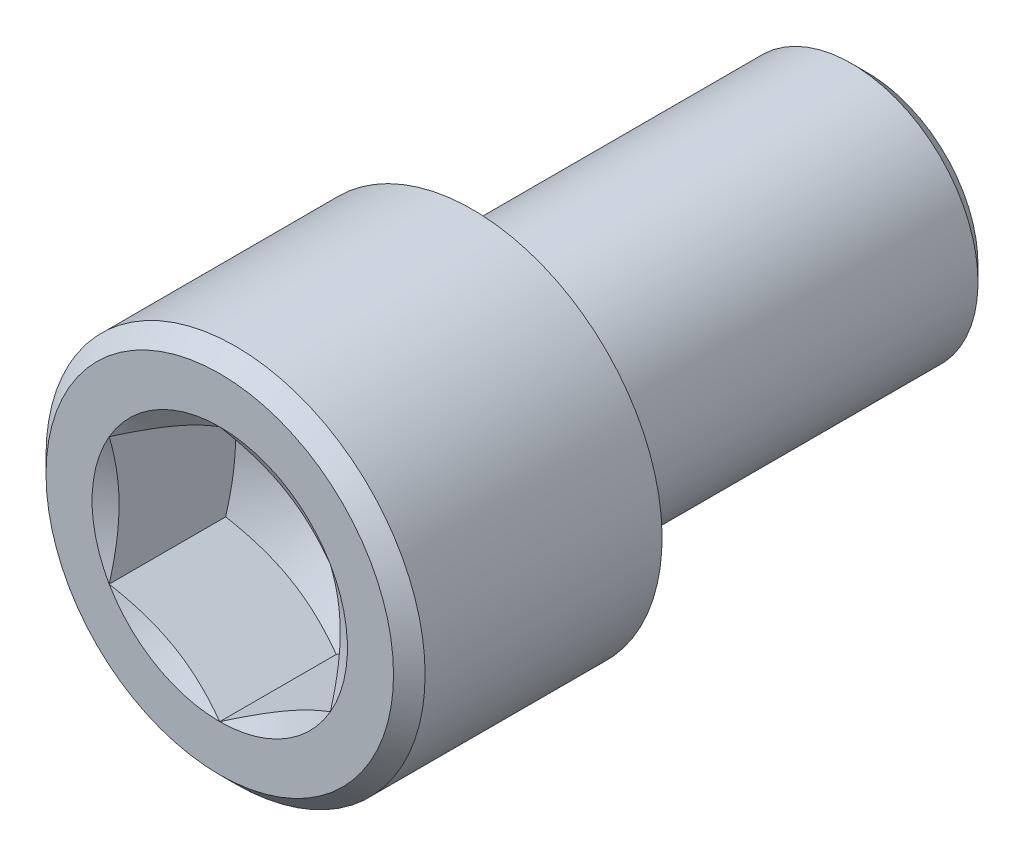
ISO-10303-21;
HEADER;
FILE_DESCRIPTION(('STEP AP214'),'2;1');
FILE_NAME('part.step','',(''),(''),'','','');
FILE_SCHEMA(('AUTOMOTIVE_DESIGN { 1 0 10303 214 1 1 1 1 }'));
ENDSEC;
DATA;
#1=APPLICATION_CONTEXT('core data for automotive mechanical design processes');
#2=APPLICATION_PROTOCOL_DEFINITION('international standard','automotive_design',2000,#1);
#3=PRODUCT_CONTEXT('',#1,'mechanical');
#4=PRODUCT('Part','Part','',(#3));
#5=PRODUCT_RELATED_PRODUCT_CATEGORY('part','',(#4));
#6=PRODUCT_DEFINITION_FORMATION('','',#4);
#7=PRODUCT_DEFINITION_CONTEXT('part definition',#1,'design');
#8=PRODUCT_DEFINITION('design','',#6,#7);
#9=PRODUCT_DEFINITION_SHAPE('','',#8);
#10=(LENGTH_UNIT() NAMED_UNIT(*) SI_UNIT(.MILLI.,.METRE.));
#11=(NAMED_UNIT(*) PLANE_ANGLE_UNIT() SI_UNIT($,.RADIAN.));
#12=(NAMED_UNIT(*) SI_UNIT($,.STERADIAN.) SOLID_ANGLE_UNIT());
#13=UNCERTAINTY_MEASURE_WITH_UNIT(LENGTH_MEASURE(1.E-05),#10,'distance_accuracy_value','');
#14=(GEOMETRIC_REPRESENTATION_CONTEXT(3) GLOBAL_UNCERTAINTY_ASSIGNED_CONTEXT((#13)) GLOBAL_UNIT_ASSIGNED_CONTEXT((#10,
#11,#12)) REPRESENTATION_CONTEXT('',''));
#15=CARTESIAN_POINT('',(0.,0.,0.));
#16=DIRECTION('',(0.,0.,1.));
#17=DIRECTION('',(1.,0.,0.));
#18=AXIS2_PLACEMENT_3D('',#15,#16,#17);
#19=CARTESIAN_POINT('',(0.,12.,16.));
#20=DIRECTION('',(0.,0.,-1.));
#21=DIRECTION('',(0.,1.,0.));
#22=AXIS2_PLACEMENT_3D('',#19,#20,#21);
#23=PLANE('',#22);
#24=CARTESIAN_POINT('',(0.,0.,16.));
#25=DIRECTION('',(0.,0.,-1.));
#26=DIRECTION('',(0.,1.,0.));
#27=AXIS2_PLACEMENT_3D('',#24,#25,#26);
#28=CIRCLE('',#27,11.);
#29=CARTESIAN_POINT('',(0.,11.,16.));
#30=VERTEX_POINT('',#29);
#31=EDGE_CURVE('E298',#30,#30,#28,.F.);
#32=ORIENTED_EDGE('',*,*,#31,.T.);
#33=EDGE_LOOP('',(#32));
#34=FACE_BOUND('',#33,.T.);
#35=CARTESIAN_POINT('',(0.,0.,16.));
#36=DIRECTION('',(0.,0.,-1.));
#37=DIRECTION('',(0.,1.,0.));
#38=AXIS2_PLACEMENT_3D('',#35,#36,#37);
#39=CIRCLE('',#38,8.08290376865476);
#40=CARTESIAN_POINT('',(0.,8.08290376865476,16.));
#41=VERTEX_POINT('',#40);
#42=CARTESIAN_POINT('',(-7.,4.04145188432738,16.));
#43=VERTEX_POINT('',#42);
#44=EDGE_CURVE('E111',#41,#43,#39,.F.);
#45=ORIENTED_EDGE('',*,*,#44,.F.);
#46=CARTESIAN_POINT('',(7.,4.04145188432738,16.));
#47=VERTEX_POINT('',#46);
#48=EDGE_CURVE('E99',#47,#41,#39,.F.);
#49=ORIENTED_EDGE('',*,*,#48,.F.);
#50=CARTESIAN_POINT('',(7.,-4.04145188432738,16.));
#51=VERTEX_POINT('',#50);
#52=EDGE_CURVE('E109',#51,#47,#39,.F.);
#53=ORIENTED_EDGE('',*,*,#52,.F.);
#54=CARTESIAN_POINT('',(0.,-8.08290376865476,16.));
#55=VERTEX_POINT('',#54);
#56=EDGE_CURVE('E442',#55,#51,#39,.F.);
#57=ORIENTED_EDGE('',*,*,#56,.F.);
#58=CARTESIAN_POINT('',(-7.,-4.04145188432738,16.));
#59=VERTEX_POINT('',#58);
#60=EDGE_CURVE('E145',#59,#55,#39,.F.);
#61=ORIENTED_EDGE('',*,*,#60,.F.);
#62=EDGE_CURVE('E141',#43,#59,#39,.F.);
#63=ORIENTED_EDGE('',*,*,#62,.F.);
#64=EDGE_LOOP('',(#45,#49,#53,#57,#61,#63));
#65=FACE_BOUND('',#64,.T.);
#66=ADVANCED_FACE('F42',(#34,#65),#23,.F.);
#67=CARTESIAN_POINT('',(0.,8.,0.));
#68=DIRECTION('',(0.,0.,1.));
#69=DIRECTION('',(0.,-1.,0.));
#70=AXIS2_PLACEMENT_3D('',#67,#68,#69);
#71=PLANE('',#70);
#72=CARTESIAN_POINT('',(0.,0.,0.));
#73=DIRECTION('',(0.,0.,1.));
#74=DIRECTION('',(0.,-1.,0.));
#75=AXIS2_PLACEMENT_3D('',#72,#73,#74);
#76=CIRCLE('',#75,8.6);
#77=CARTESIAN_POINT('',(0.,-8.6,0.));
#78=VERTEX_POINT('',#77);
#79=EDGE_CURVE('E51',#78,#78,#76,.T.);
#80=ORIENTED_EDGE('',*,*,#79,.T.);
#81=EDGE_LOOP('',(#80));
#82=FACE_BOUND('',#81,.T.);
#83=CARTESIAN_POINT('',(0.,0.,0.));
#84=DIRECTION('',(0.,0.,1.));
#85=DIRECTION('',(0.,-1.,0.));
#86=AXIS2_PLACEMENT_3D('',#83,#84,#85);
#87=CIRCLE('',#86,12.);
#88=CARTESIAN_POINT('',(0.,-12.,0.));
#89=VERTEX_POINT('',#88);
#90=EDGE_CURVE('E465',#89,#89,#87,.T.);
#91=ORIENTED_EDGE('',*,*,#90,.F.);
#92=EDGE_LOOP('',(#91));
#93=FACE_BOUND('',#92,.T.);
#94=ADVANCED_FACE('F259',(#82,#93),#71,.F.);
#95=CARTESIAN_POINT('',(0.,0.,16.));
#96=DIRECTION('',(0.,0.,1.));
#97=DIRECTION('',(0.,-1.,0.));
#98=AXIS2_PLACEMENT_3D('',#95,#96,#97);
#99=CYLINDRICAL_SURFACE('',#98,12.);
#100=CARTESIAN_POINT('',(0.,0.,15.));
#101=DIRECTION('',(0.,0.,-1.));
#102=DIRECTION('',(0.,1.,0.));
#103=AXIS2_PLACEMENT_3D('',#100,#101,#102);
#104=CIRCLE('',#103,12.);
#105=CARTESIAN_POINT('',(0.,12.,15.));
#106=VERTEX_POINT('',#105);
#107=EDGE_CURVE('E290',#106,#106,#104,.T.);
#108=ORIENTED_EDGE('',*,*,#107,.T.);
#109=EDGE_LOOP('',(#108));
#110=FACE_BOUND('',#109,.T.);
#111=ORIENTED_EDGE('',*,*,#90,.T.);
#112=EDGE_LOOP('',(#111));
#113=FACE_BOUND('',#112,.T.);
#114=ADVANCED_FACE('F264',(#110,#113),#99,.T.);
#115=CARTESIAN_POINT('',(0.,0.,-25.));
#116=DIRECTION('',(0.,0.,1.));
#117=DIRECTION('',(0.,-1.,0.));
#118=AXIS2_PLACEMENT_3D('',#115,#116,#117);
#119=PLANE('',#118);
#120=CARTESIAN_POINT('',(0.,0.,-25.));
#121=DIRECTION('',(0.,0.,1.));
#122=DIRECTION('',(0.,-1.,0.));
#123=AXIS2_PLACEMENT_3D('',#120,#121,#122);
#124=CIRCLE('',#123,7.);
#125=CARTESIAN_POINT('',(0.,-7.,-25.));
#126=VERTEX_POINT('',#125);
#127=EDGE_CURVE('E122',#126,#126,#124,.F.);
#128=ORIENTED_EDGE('',*,*,#127,.T.);
#129=EDGE_LOOP('',(#128));
#130=FACE_BOUND('',#129,.T.);
#131=ADVANCED_FACE('F269',(#130),#119,.F.);
#132=CARTESIAN_POINT('',(0.,0.,16.));
#133=DIRECTION('',(0.,0.,1.));
#134=DIRECTION('',(0.,-1.,0.));
#135=AXIS2_PLACEMENT_3D('',#132,#133,#134);
#136=CYLINDRICAL_SURFACE('',#135,8.);
#137=CARTESIAN_POINT('',(0.,0.,-0.6));
#138=DIRECTION('',(0.,0.,1.));
#139=DIRECTION('',(0.,-1.,0.));
#140=AXIS2_PLACEMENT_3D('',#137,#138,#139);
#141=CIRCLE('',#140,8.);
#142=CARTESIAN_POINT('',(0.,-8.,-0.6));
#143=VERTEX_POINT('',#142);
#144=EDGE_CURVE('E12',#143,#143,#141,.F.);
#145=ORIENTED_EDGE('',*,*,#144,.T.);
#146=EDGE_LOOP('',(#145));
#147=FACE_BOUND('',#146,.T.);
#148=CARTESIAN_POINT('',(0.,0.,-24.));
#149=DIRECTION('',(0.,0.,1.));
#150=DIRECTION('',(0.,-1.,0.));
#151=AXIS2_PLACEMENT_3D('',#148,#149,#150);
#152=CIRCLE('',#151,8.);
#153=CARTESIAN_POINT('',(0.,-8.,-24.));
#154=VERTEX_POINT('',#153);
#155=EDGE_CURVE('E287',#154,#154,#152,.T.);
#156=ORIENTED_EDGE('',*,*,#155,.T.);
#157=EDGE_LOOP('',(#156));
#158=FACE_BOUND('',#157,.T.);
#159=ADVANCED_FACE('F180',(#147,#158),#136,.T.);
#160=CARTESIAN_POINT('',(0.,0.,16.));
#161=DIRECTION('',(0.,0.,-1.));
#162=DIRECTION('',(0.,1.,0.));
#163=AXIS2_PLACEMENT_3D('',#160,#161,#162);
#164=CONICAL_SURFACE('',#163,11.,0.785398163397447);
#165=ORIENTED_EDGE('',*,*,#107,.F.);
#166=EDGE_LOOP('',(#165));
#167=FACE_BOUND('',#166,.T.);
#168=ORIENTED_EDGE('',*,*,#31,.F.);
#169=EDGE_LOOP('',(#168));
#170=FACE_BOUND('',#169,.T.);
#171=ADVANCED_FACE('F273',(#167,#170),#164,.T.);
#172=CARTESIAN_POINT('',(0.,0.,-24.));
#173=DIRECTION('',(0.,0.,1.));
#174=DIRECTION('',(0.,-1.,0.));
#175=AXIS2_PLACEMENT_3D('',#172,#173,#174);
#176=CONICAL_SURFACE('',#175,8.,0.785398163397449);
#177=ORIENTED_EDGE('',*,*,#127,.F.);
#178=EDGE_LOOP('',(#177));
#179=FACE_BOUND('',#178,.T.);
#180=ORIENTED_EDGE('',*,*,#155,.F.);
#181=EDGE_LOOP('',(#180));
#182=FACE_BOUND('',#181,.T.);
#183=ADVANCED_FACE('F275',(#179,#182),#176,.T.);
#184=CARTESIAN_POINT('',(0.,0.,15.3747852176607));
#185=DIRECTION('',(0.,0.,1.));
#186=DIRECTION('',(0.,-1.,0.));
#187=AXIS2_PLACEMENT_3D('',#184,#185,#186);
#188=CONICAL_SURFACE('',#187,7.,1.04719755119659);
#189=ORIENTED_EDGE('',*,*,#44,.T.);
#190=CARTESIAN_POINT('',(-7.0002,4.04133641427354,16.0000666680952));
#191=CARTESIAN_POINT('',(-6.84633209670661,4.13017208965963,15.9487850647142));
#192=CARTESIAN_POINT('',(-6.69189049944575,4.21933898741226,15.8998308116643));
#193=CARTESIAN_POINT('',(-6.38175307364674,4.39839691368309,15.8072180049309));
#194=CARTESIAN_POINT('',(-6.22605673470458,4.48828823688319,15.7635617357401));
#195=CARTESIAN_POINT('',(-5.75647483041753,4.75940147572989,15.6413968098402));
#196=CARTESIAN_POINT('',(-5.4407356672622,4.94169356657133,15.5719107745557));
#197=CARTESIAN_POINT('',(-4.96823775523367,5.21449036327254,15.4904301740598));
#198=CARTESIAN_POINT('',(-4.81289077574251,5.30417998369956,15.4672187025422));
#199=CARTESIAN_POINT('',(-4.50149488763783,5.48396448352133,15.4282964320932));
#200=CARTESIAN_POINT('',(-4.34544604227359,5.57405932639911,15.4125849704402));
#201=CARTESIAN_POINT('',(-4.03307732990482,5.75440548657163,15.3890631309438));
#202=CARTESIAN_POINT('',(-3.87675797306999,5.84465650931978,15.3812437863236));
#203=CARTESIAN_POINT('',(-3.56398349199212,6.02523694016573,15.373665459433));
#204=CARTESIAN_POINT('',(-3.40752837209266,6.11556634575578,15.3739062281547));
#205=CARTESIAN_POINT('',(-2.97889312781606,6.36303901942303,15.3856449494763));
#206=CARTESIAN_POINT('',(-2.7068533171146,6.52010127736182,15.4053509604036));
#207=CARTESIAN_POINT('',(-2.1645805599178,6.83318259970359,15.4678386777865));
#208=CARTESIAN_POINT('',(-1.89434952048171,6.9892005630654,15.5106417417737));
#209=CARTESIAN_POINT('',(-1.35098545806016,7.30291195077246,15.6176368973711));
#210=CARTESIAN_POINT('',(-1.07792099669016,7.46056579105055,15.6822823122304));
#211=CARTESIAN_POINT('',(-0.53586421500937,7.77352241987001,15.8290012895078));
#212=CARTESIAN_POINT('',(-0.26686495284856,7.92882921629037,15.9110403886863));
#213=CARTESIAN_POINT('',(0.000199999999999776,8.0830192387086,16.0000666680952));
#214=B_SPLINE_CURVE_WITH_KNOTS('',3,(#190,#191,#192,#193,#194,#195,#196,#197,#198,#199,#200,
#201,#202,#203,#204,#205,#206,#207,#208,#209,#210,#211,#212,#213),.UNSPECIFIED.,.F.,.F.,(4,2,2,
2,2,2,2,2,2,2,2,4),(0.,0.554727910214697,1.1096941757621,2.22193274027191,2.76443041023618,
3.30688013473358,3.84871284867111,4.3905288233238,5.33376515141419,6.27787517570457,
7.24292418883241,8.20607866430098),.UNSPECIFIED.);
#215=EDGE_CURVE('E115',#43,#41,#214,.T.);
#216=ORIENTED_EDGE('',*,*,#215,.T.);
#217=EDGE_LOOP('',(#189,#216));
#218=FACE_BOUND('',#217,.T.);
#219=ADVANCED_FACE('F116',(#218),#188,.F.);
#220=ORIENTED_EDGE('',*,*,#62,.T.);
#221=CARTESIAN_POINT('',(-7.,-10.718525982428,18.7244721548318));
#222=CARTESIAN_POINT('',(-7.,-10.4111863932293,18.5759486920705));
#223=CARTESIAN_POINT('',(-7.,-10.1031201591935,18.4289016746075));
#224=CARTESIAN_POINT('',(-7.,-9.48514148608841,18.1386042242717));
#225=CARTESIAN_POINT('',(-7.,-9.1752287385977,17.9953544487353));
#226=CARTESIAN_POINT('',(-7.,-8.55148999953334,17.7127405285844));
#227=CARTESIAN_POINT('',(-7.,-8.23765176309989,17.5734033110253));
#228=CARTESIAN_POINT('',(-7.,-7.60739587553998,17.300713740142));
#229=CARTESIAN_POINT('',(-7.,-7.29097835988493,17.1673610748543));
#230=CARTESIAN_POINT('',(-7.,-6.65113230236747,16.9066488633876));
#231=CARTESIAN_POINT('',(-7.,-6.32766537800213,16.779382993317));
#232=CARTESIAN_POINT('',(-7.,-5.67691706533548,16.534818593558));
#233=CARTESIAN_POINT('',(-7.,-5.34963525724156,16.4175211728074));
#234=CARTESIAN_POINT('',(-7.,-4.6914046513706,16.1960458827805));
#235=CARTESIAN_POINT('',(-7.,-4.36046534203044,16.0918401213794));
#236=CARTESIAN_POINT('',(-7.,-3.69389387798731,15.8999306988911));
#237=CARTESIAN_POINT('',(-7.,-3.35826324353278,15.812221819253));
#238=CARTESIAN_POINT('',(-7.,-2.68202380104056,15.6575705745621));
#239=CARTESIAN_POINT('',(-7.,-2.34141369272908,15.5906337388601));
#240=CARTESIAN_POINT('',(-7.,-1.82750129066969,15.5091591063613));
#241=CARTESIAN_POINT('',(-7.,-1.65567653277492,15.4851542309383));
#242=CARTESIAN_POINT('',(-7.,-1.31122142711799,15.4439270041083));
#243=CARTESIAN_POINT('',(-7.,-1.13859116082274,15.426703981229));
#244=CARTESIAN_POINT('',(-7.,-0.793853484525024,15.3995039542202));
#245=CARTESIAN_POINT('',(-7.,-0.621749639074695,15.3894819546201));
#246=CARTESIAN_POINT('',(-7.,-0.277271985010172,15.3767369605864));
#247=CARTESIAN_POINT('',(-7.,-0.104898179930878,15.3740138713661));
#248=CARTESIAN_POINT('',(-7.,0.239760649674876,15.3759315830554));
#249=CARTESIAN_POINT('',(-7.,0.412045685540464,15.3805703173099));
#250=CARTESIAN_POINT('',(-7.,0.756270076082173,15.3970963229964));
#251=CARTESIAN_POINT('',(-7.,0.928209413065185,15.408983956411));
#252=CARTESIAN_POINT('',(-7.,1.34493742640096,15.4463326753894));
#253=CARTESIAN_POINT('',(-7.,1.58940592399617,15.4754257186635));
#254=CARTESIAN_POINT('',(-7.,2.07646957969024,15.5466512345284));
#255=CARTESIAN_POINT('',(-7.,2.31906420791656,15.5887872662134));
#256=CARTESIAN_POINT('',(-7.,2.80217998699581,15.6846043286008));
#257=CARTESIAN_POINT('',(-7.,3.04269895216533,15.7382962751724));
#258=CARTESIAN_POINT('',(-7.,3.52126228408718,15.8555869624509));
#259=CARTESIAN_POINT('',(-7.,3.75930688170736,15.9191847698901));
#260=CARTESIAN_POINT('',(-7.,4.23878446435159,16.0564281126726));
#261=CARTESIAN_POINT('',(-7.,4.48015747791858,16.1302817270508));
#262=CARTESIAN_POINT('',(-7.,4.96035218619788,16.2852861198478));
#263=CARTESIAN_POINT('',(-7.,5.1991755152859,16.3664318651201));
#264=CARTESIAN_POINT('',(-7.,5.67331254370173,16.5343443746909));
#265=CARTESIAN_POINT('',(-7.,5.90863843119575,16.6210769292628));
#266=CARTESIAN_POINT('',(-7.,6.377464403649,16.7996327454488));
#267=CARTESIAN_POINT('',(-7.,6.61096370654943,16.8914580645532));
#268=CARTESIAN_POINT('',(-7.,6.8436147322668,16.9853259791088));
#269=B_SPLINE_CURVE_WITH_KNOTS('',3,(#221,#222,#223,#224,#225,#226,#227,#228,#229,#230,#231,
#232,#233,#234,#235,#236,#237,#238,#239,#240,#241,#242,#243,#244,#245,#246,#247,#248,#249,#250,
#251,#252,#253,#254,#255,#256,#257,#258,#259,#260,#261,#262,#263,#264,#265,#266,#267,#268),
.UNSPECIFIED.,.F.,.F.,(4,2,2,2,2,2,2,2,2,2,2,2,2,2,2,2,2,2,2,2,2,2,2,4),(0.,1.02405063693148,
2.04827740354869,3.07836540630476,4.10839964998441,5.15107951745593,6.19387522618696,
7.23441013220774,8.27461532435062,9.31509717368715,9.83546471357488,10.35578071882,
10.8728165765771,11.3898457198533,11.9067297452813,12.4236395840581,13.1618088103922,
13.9001796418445,14.6392510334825,15.3782528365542,16.1353691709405,16.8919668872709,
17.6443059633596,18.3969512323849),.UNSPECIFIED.);
#270=EDGE_CURVE('E242',#59,#43,#269,.T.);
#271=ORIENTED_EDGE('',*,*,#270,.T.);
#272=EDGE_LOOP('',(#220,#271));
#273=FACE_BOUND('',#272,.T.);
#274=ADVANCED_FACE('F281',(#273),#188,.F.);
#275=ORIENTED_EDGE('',*,*,#60,.T.);
#276=CARTESIAN_POINT('',(0.000200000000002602,-8.0830192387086,16.0000666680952));
#277=CARTESIAN_POINT('',(-0.153667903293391,-7.99418356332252,15.9487850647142));
#278=CARTESIAN_POINT('',(-0.308109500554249,-7.90501666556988,15.8998308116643));
#279=CARTESIAN_POINT('',(-0.618246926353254,-7.72595873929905,15.8072180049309));
#280=CARTESIAN_POINT('',(-0.773943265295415,-7.63606741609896,15.7635617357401));
#281=CARTESIAN_POINT('',(-1.24352516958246,-7.36495417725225,15.6413968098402));
#282=CARTESIAN_POINT('',(-1.5592643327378,-7.18266208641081,15.5719107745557));
#283=CARTESIAN_POINT('',(-2.03176224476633,-6.9098652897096,15.4904301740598));
#284=CARTESIAN_POINT('',(-2.18710922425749,-6.82017566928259,15.4672187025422));
#285=CARTESIAN_POINT('',(-2.49850511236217,-6.64039116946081,15.4282964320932));
#286=CARTESIAN_POINT('',(-2.65455395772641,-6.55029632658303,15.4125849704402));
#287=CARTESIAN_POINT('',(-2.96692267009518,-6.36995016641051,15.3890631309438));
#288=CARTESIAN_POINT('',(-3.12324202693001,-6.27969914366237,15.3812437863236));
#289=CARTESIAN_POINT('',(-3.43601650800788,-6.09911871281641,15.373665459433));
#290=CARTESIAN_POINT('',(-3.59247162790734,-6.00878930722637,15.3739062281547));
#291=CARTESIAN_POINT('',(-4.02110687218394,-5.76131663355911,15.3856449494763));
#292=CARTESIAN_POINT('',(-4.2931466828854,-5.60425437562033,15.4053509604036));
#293=CARTESIAN_POINT('',(-4.8354194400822,-5.29117305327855,15.4678386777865));
#294=CARTESIAN_POINT('',(-5.10565047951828,-5.13515508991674,15.5106417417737));
#295=CARTESIAN_POINT('',(-5.64901454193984,-4.82144370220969,15.6176368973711));
#296=CARTESIAN_POINT('',(-5.92207900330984,-4.66378986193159,15.6822823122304));
#297=CARTESIAN_POINT('',(-6.46413578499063,-4.35083323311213,15.8290012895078));
#298=CARTESIAN_POINT('',(-6.73313504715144,-4.19552643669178,15.9110403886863));
#299=CARTESIAN_POINT('',(-7.0002,-4.04133641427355,16.0000666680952));
#300=B_SPLINE_CURVE_WITH_KNOTS('',3,(#276,#277,#278,#279,#280,#281,#282,#283,#284,#285,#286,
#287,#288,#289,#290,#291,#292,#293,#294,#295,#296,#297,#298,#299),.UNSPECIFIED.,.F.,.F.,(4,2,2,
2,2,2,2,2,2,2,2,4),(0.,0.554727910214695,1.10969417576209,2.2219327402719,2.76443041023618,
3.30688013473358,3.84871284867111,4.3905288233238,5.33376515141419,6.27787517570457,
7.2429241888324,8.20607866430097),.UNSPECIFIED.);
#301=EDGE_CURVE('E235',#55,#59,#300,.T.);
#302=ORIENTED_EDGE('',*,*,#301,.T.);
#303=EDGE_LOOP('',(#275,#302));
#304=FACE_BOUND('',#303,.T.);
#305=ADVANCED_FACE('F381',(#304),#188,.F.);
#306=ORIENTED_EDGE('',*,*,#56,.T.);
#307=CARTESIAN_POINT('',(7.0002,-4.04133641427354,16.0000666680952));
#308=CARTESIAN_POINT('',(6.84633209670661,-4.13017208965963,15.9487850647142));
#309=CARTESIAN_POINT('',(6.69189049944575,-4.21933898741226,15.8998308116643));
#310=CARTESIAN_POINT('',(6.38175307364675,-4.39839691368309,15.8072180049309));
#311=CARTESIAN_POINT('',(6.22605673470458,-4.48828823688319,15.7635617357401));
#312=CARTESIAN_POINT('',(5.75647483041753,-4.7594014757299,15.6413968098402));
#313=CARTESIAN_POINT('',(5.4407356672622,-4.94169356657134,15.5719107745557));
#314=CARTESIAN_POINT('',(4.96823775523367,-5.21449036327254,15.4904301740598));
#315=CARTESIAN_POINT('',(4.81289077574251,-5.30417998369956,15.4672187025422));
#316=CARTESIAN_POINT('',(4.50149488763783,-5.48396448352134,15.4282964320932));
#317=CARTESIAN_POINT('',(4.34544604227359,-5.57405932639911,15.4125849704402));
#318=CARTESIAN_POINT('',(4.03307732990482,-5.75440548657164,15.3890631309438));
#319=CARTESIAN_POINT('',(3.87675797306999,-5.84465650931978,15.3812437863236));
#320=CARTESIAN_POINT('',(3.56398349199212,-6.02523694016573,15.373665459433));
#321=CARTESIAN_POINT('',(3.40752837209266,-6.11556634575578,15.3739062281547));
#322=CARTESIAN_POINT('',(2.97889312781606,-6.36303901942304,15.3856449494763));
#323=CARTESIAN_POINT('',(2.7068533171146,-6.52010127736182,15.4053509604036));
#324=CARTESIAN_POINT('',(2.1645805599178,-6.83318259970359,15.4678386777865));
#325=CARTESIAN_POINT('',(1.89434952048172,-6.98920056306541,15.5106417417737));
#326=CARTESIAN_POINT('',(1.35098545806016,-7.30291195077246,15.6176368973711));
#327=CARTESIAN_POINT('',(1.07792099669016,-7.46056579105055,15.6822823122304));
#328=CARTESIAN_POINT('',(0.535864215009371,-7.77352241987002,15.8290012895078));
#329=CARTESIAN_POINT('',(0.266864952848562,-7.92882921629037,15.9110403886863));
#330=CARTESIAN_POINT('',(-0.000199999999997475,-8.0830192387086,16.0000666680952));
#331=B_SPLINE_CURVE_WITH_KNOTS('',3,(#307,#308,#309,#310,#311,#312,#313,#314,#315,#316,#317,
#318,#319,#320,#321,#322,#323,#324,#325,#326,#327,#328,#329,#330),.UNSPECIFIED.,.F.,.F.,(4,2,2,
2,2,2,2,2,2,2,2,4),(0.,0.554727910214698,1.10969417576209,2.22193274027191,2.76443041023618,
3.30688013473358,3.84871284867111,4.3905288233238,5.33376515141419,6.27787517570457,
7.24292418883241,8.20607866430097),.UNSPECIFIED.);
#332=EDGE_CURVE('E63',#51,#55,#331,.T.);
#333=ORIENTED_EDGE('',*,*,#332,.T.);
#334=EDGE_LOOP('',(#306,#333));
#335=FACE_BOUND('',#334,.T.);
#336=ADVANCED_FACE('F374',(#335),#188,.F.);
#337=ORIENTED_EDGE('',*,*,#52,.T.);
#338=CARTESIAN_POINT('',(7.,-10.718525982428,18.7244721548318));
#339=CARTESIAN_POINT('',(7.,-10.4111863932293,18.5759486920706));
#340=CARTESIAN_POINT('',(7.,-10.1031201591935,18.4289016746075));
#341=CARTESIAN_POINT('',(7.,-9.48514148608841,18.1386042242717));
#342=CARTESIAN_POINT('',(7.,-9.17522873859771,17.9953544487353));
#343=CARTESIAN_POINT('',(7.,-8.55148999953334,17.7127405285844));
#344=CARTESIAN_POINT('',(7.,-8.23765176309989,17.5734033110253));
#345=CARTESIAN_POINT('',(7.,-7.60739587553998,17.300713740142));
#346=CARTESIAN_POINT('',(7.,-7.29097835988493,17.1673610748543));
#347=CARTESIAN_POINT('',(7.,-6.65113230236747,16.9066488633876));
#348=CARTESIAN_POINT('',(7.,-6.32766537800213,16.779382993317));
#349=CARTESIAN_POINT('',(7.,-5.67691706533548,16.534818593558));
#350=CARTESIAN_POINT('',(7.,-5.34963525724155,16.4175211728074));
#351=CARTESIAN_POINT('',(7.,-4.6914046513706,16.1960458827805));
#352=CARTESIAN_POINT('',(7.,-4.36046534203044,16.0918401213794));
#353=CARTESIAN_POINT('',(7.,-3.69389387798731,15.8999306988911));
#354=CARTESIAN_POINT('',(7.,-3.35826324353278,15.812221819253));
#355=CARTESIAN_POINT('',(7.,-2.68202380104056,15.6575705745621));
#356=CARTESIAN_POINT('',(7.,-2.34141369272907,15.5906337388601));
#357=CARTESIAN_POINT('',(7.,-1.82750129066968,15.5091591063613));
#358=CARTESIAN_POINT('',(7.,-1.65567653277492,15.4851542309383));
#359=CARTESIAN_POINT('',(7.,-1.31122142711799,15.4439270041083));
#360=CARTESIAN_POINT('',(7.,-1.13859116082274,15.426703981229));
#361=CARTESIAN_POINT('',(7.,-0.793853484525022,15.3995039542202));
#362=CARTESIAN_POINT('',(7.,-0.621749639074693,15.3894819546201));
#363=CARTESIAN_POINT('',(7.,-0.27727198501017,15.3767369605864));
#364=CARTESIAN_POINT('',(7.,-0.104898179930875,15.3740138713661));
#365=CARTESIAN_POINT('',(7.,0.239760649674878,15.3759315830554));
#366=CARTESIAN_POINT('',(7.,0.412045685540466,15.3805703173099));
#367=CARTESIAN_POINT('',(7.,0.756270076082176,15.3970963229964));
#368=CARTESIAN_POINT('',(7.,0.928209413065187,15.408983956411));
#369=CARTESIAN_POINT('',(7.,1.34493742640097,15.4463326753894));
#370=CARTESIAN_POINT('',(7.,1.58940592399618,15.4754257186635));
#371=CARTESIAN_POINT('',(7.,2.07646957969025,15.5466512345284));
#372=CARTESIAN_POINT('',(7.,2.31906420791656,15.5887872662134));
#373=CARTESIAN_POINT('',(7.,2.80217998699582,15.6846043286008));
#374=CARTESIAN_POINT('',(7.,3.04269895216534,15.7382962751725));
#375=CARTESIAN_POINT('',(7.,3.52126228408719,15.8555869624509));
#376=CARTESIAN_POINT('',(7.,3.75930688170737,15.9191847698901));
#377=CARTESIAN_POINT('',(7.,4.2387844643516,16.0564281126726));
#378=CARTESIAN_POINT('',(7.,4.48015747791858,16.1302817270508));
#379=CARTESIAN_POINT('',(7.,4.96035218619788,16.2852861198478));
#380=CARTESIAN_POINT('',(7.,5.1991755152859,16.3664318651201));
#381=CARTESIAN_POINT('',(7.,5.67331254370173,16.5343443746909));
#382=CARTESIAN_POINT('',(7.,5.90863843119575,16.6210769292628));
#383=CARTESIAN_POINT('',(7.,6.377464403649,16.7996327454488));
#384=CARTESIAN_POINT('',(7.,6.61096370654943,16.8914580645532));
#385=CARTESIAN_POINT('',(7.,6.84361473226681,16.9853259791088));
#386=B_SPLINE_CURVE_WITH_KNOTS('',3,(#338,#339,#340,#341,#342,#343,#344,#345,#346,#347,#348,
#349,#350,#351,#352,#353,#354,#355,#356,#357,#358,#359,#360,#361,#362,#363,#364,#365,#366,#367,
#368,#369,#370,#371,#372,#373,#374,#375,#376,#377,#378,#379,#380,#381,#382,#383,#384,#385),
.UNSPECIFIED.,.F.,.F.,(4,2,2,2,2,2,2,2,2,2,2,2,2,2,2,2,2,2,2,2,2,2,2,4),(0.,1.02405063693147,
2.04827740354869,3.07836540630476,4.10839964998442,5.15107951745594,6.19387522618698,
7.23441013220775,8.27461532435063,9.31509717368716,9.83546471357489,10.35578071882,
10.8728165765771,11.3898457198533,11.9067297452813,12.4236395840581,13.1618088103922,
13.9001796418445,14.6392510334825,15.3782528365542,16.1353691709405,16.8919668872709,
17.6443059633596,18.3969512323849),.UNSPECIFIED.);
#387=EDGE_CURVE('E57',#47,#51,#386,.F.);
#388=ORIENTED_EDGE('',*,*,#387,.T.);
#389=EDGE_LOOP('',(#337,#388));
#390=FACE_BOUND('',#389,.T.);
#391=ADVANCED_FACE('F367',(#390),#188,.F.);
#392=ORIENTED_EDGE('',*,*,#48,.T.);
#393=CARTESIAN_POINT('',(-0.000200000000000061,8.0830192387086,16.0000666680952));
#394=CARTESIAN_POINT('',(0.153667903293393,7.99418356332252,15.9487850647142));
#395=CARTESIAN_POINT('',(0.308109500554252,7.90501666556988,15.8998308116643));
#396=CARTESIAN_POINT('',(0.618246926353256,7.72595873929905,15.8072180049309));
#397=CARTESIAN_POINT('',(0.773943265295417,7.63606741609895,15.7635617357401));
#398=CARTESIAN_POINT('',(1.24352516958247,7.36495417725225,15.6413968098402));
#399=CARTESIAN_POINT('',(1.5592643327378,7.18266208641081,15.5719107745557));
#400=CARTESIAN_POINT('',(2.03176224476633,6.9098652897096,15.4904301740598));
#401=CARTESIAN_POINT('',(2.18710922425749,6.82017566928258,15.4672187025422));
#402=CARTESIAN_POINT('',(2.49850511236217,6.64039116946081,15.4282964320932));
#403=CARTESIAN_POINT('',(2.65455395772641,6.55029632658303,15.4125849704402));
#404=CARTESIAN_POINT('',(2.96692267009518,6.36995016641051,15.3890631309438));
#405=CARTESIAN_POINT('',(3.12324202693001,6.27969914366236,15.3812437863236));
#406=CARTESIAN_POINT('',(3.43601650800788,6.09911871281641,15.373665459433));
#407=CARTESIAN_POINT('',(3.59247162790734,6.00878930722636,15.3739062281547));
#408=CARTESIAN_POINT('',(4.02110687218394,5.76131663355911,15.3856449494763));
#409=CARTESIAN_POINT('',(4.2931466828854,5.60425437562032,15.4053509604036));
#410=CARTESIAN_POINT('',(4.8354194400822,5.29117305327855,15.4678386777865));
#411=CARTESIAN_POINT('',(5.10565047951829,5.13515508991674,15.5106417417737));
#412=CARTESIAN_POINT('',(5.64901454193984,4.82144370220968,15.6176368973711));
#413=CARTESIAN_POINT('',(5.92207900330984,4.66378986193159,15.6822823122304));
#414=CARTESIAN_POINT('',(6.46413578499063,4.35083323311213,15.8290012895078));
#415=CARTESIAN_POINT('',(6.73313504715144,4.19552643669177,15.9110403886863));
#416=CARTESIAN_POINT('',(7.0002,4.04133641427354,16.0000666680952));
#417=B_SPLINE_CURVE_WITH_KNOTS('',3,(#393,#394,#395,#396,#397,#398,#399,#400,#401,#402,#403,
#404,#405,#406,#407,#408,#409,#410,#411,#412,#413,#414,#415,#416),.UNSPECIFIED.,.F.,.F.,(4,2,2,
2,2,2,2,2,2,2,2,4),(0.,0.554727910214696,1.10969417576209,2.2219327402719,2.76443041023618,
3.30688013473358,3.84871284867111,4.3905288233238,5.33376515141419,6.27787517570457,
7.24292418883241,8.20607866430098),.UNSPECIFIED.);
#418=EDGE_CURVE('E103',#41,#47,#417,.T.);
#419=ORIENTED_EDGE('',*,*,#418,.T.);
#420=EDGE_LOOP('',(#392,#419));
#421=FACE_BOUND('',#420,.T.);
#422=ADVANCED_FACE('F101',(#421),#188,.F.);
#423=CARTESIAN_POINT('',(0.,0.,3.95854811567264));
#424=DIRECTION('',(0.,0.,1.));
#425=DIRECTION('',(1.,0.,0.));
#426=AXIS2_PLACEMENT_3D('',#423,#424,#425);
#427=CONICAL_SURFACE('',#426,0.,1.0471975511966);
#428=CARTESIAN_POINT('',(7.0002,-4.04133641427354,8.6252814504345));
#429=CARTESIAN_POINT('',(6.84633209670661,-4.13017208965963,8.57399984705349));
#430=CARTESIAN_POINT('',(6.69189049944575,-4.21933898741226,8.52504559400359));
#431=CARTESIAN_POINT('',(6.38175307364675,-4.39839691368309,8.43243278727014));
#432=CARTESIAN_POINT('',(6.22605673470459,-4.48828823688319,8.38877651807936));
#433=CARTESIAN_POINT('',(5.75647483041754,-4.7594014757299,8.2666115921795));
#434=CARTESIAN_POINT('',(5.4407356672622,-4.94169356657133,8.19712555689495));
#435=CARTESIAN_POINT('',(4.96823775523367,-5.21449036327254,8.1156449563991));
#436=CARTESIAN_POINT('',(4.81289077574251,-5.30417998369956,8.09243348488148));
#437=CARTESIAN_POINT('',(4.50149488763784,-5.48396448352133,8.05351121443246));
#438=CARTESIAN_POINT('',(4.34544604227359,-5.57405932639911,8.03779975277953));
#439=CARTESIAN_POINT('',(4.03307732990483,-5.75440548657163,8.01427791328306));
#440=CARTESIAN_POINT('',(3.87675797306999,-5.84465650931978,8.00645856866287));
#441=CARTESIAN_POINT('',(3.56398349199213,-6.02523694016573,7.99888024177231));
#442=CARTESIAN_POINT('',(3.40752837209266,-6.11556634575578,7.99912101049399));
#443=CARTESIAN_POINT('',(2.97889312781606,-6.36303901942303,8.01085973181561));
#444=CARTESIAN_POINT('',(2.7068533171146,-6.52010127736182,8.03056574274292));
#445=CARTESIAN_POINT('',(2.16458055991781,-6.83318259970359,8.09305346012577));
#446=CARTESIAN_POINT('',(1.89434952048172,-6.9892005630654,8.13585652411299));
#447=CARTESIAN_POINT('',(1.35098545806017,-7.30291195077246,8.24285167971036));
#448=CARTESIAN_POINT('',(1.07792099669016,-7.46056579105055,8.30749709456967));
#449=CARTESIAN_POINT('',(0.535864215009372,-7.77352241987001,8.45421607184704));
#450=CARTESIAN_POINT('',(0.266864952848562,-7.92882921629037,8.53625517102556));
#451=CARTESIAN_POINT('',(-0.000199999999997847,-8.0830192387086,8.6252814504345));
#452=B_SPLINE_CURVE_WITH_KNOTS('',3,(#428,#429,#430,#431,#432,#433,#434,#435,#436,#437,#438,
#439,#440,#441,#442,#443,#444,#445,#446,#447,#448,#449,#450,#451),.UNSPECIFIED.,.F.,.F.,(4,2,2,
2,2,2,2,2,2,2,2,4),(0.,0.554727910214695,1.10969417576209,2.2219327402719,2.76443041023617,
3.30688013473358,3.8487128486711,4.39052882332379,5.33376515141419,6.27787517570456,
7.2429241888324,8.20607866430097),.UNSPECIFIED.);
#453=CARTESIAN_POINT('',(7.,-4.04145188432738,8.62521478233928));
#454=VERTEX_POINT('',#453);
#455=CARTESIAN_POINT('',(0.,-8.08290376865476,8.62521478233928));
#456=VERTEX_POINT('',#455);
#457=EDGE_CURVE('E194',#454,#456,#452,.T.);
#458=ORIENTED_EDGE('',*,*,#457,.F.);
#459=CARTESIAN_POINT('',(7.,-10.7633874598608,11.3713862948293));
#460=CARTESIAN_POINT('',(7.,-10.458142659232,11.2236898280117));
#461=CARTESIAN_POINT('',(7.,-10.1521865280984,11.0774377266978));
#462=CARTESIAN_POINT('',(7.,-9.53847237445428,10.7886375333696));
#463=CARTESIAN_POINT('',(7.,-9.2307140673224,10.6460900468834));
#464=CARTESIAN_POINT('',(7.,-8.61138894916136,10.364778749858));
#465=CARTESIAN_POINT('',(7.,-8.29981046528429,10.2260405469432));
#466=CARTESIAN_POINT('',(7.,-7.67413940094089,9.95437598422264));
#467=CARTESIAN_POINT('',(7.,-7.3600469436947,9.82144934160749));
#468=CARTESIAN_POINT('',(7.,-6.7196404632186,9.55917679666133));
#469=CARTESIAN_POINT('',(7.,-6.39323699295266,9.43004807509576));
#470=CARTESIAN_POINT('',(7.,-5.73658007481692,9.18178926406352));
#471=CARTESIAN_POINT('',(7.,-5.40632619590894,9.06266030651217));
#472=CARTESIAN_POINT('',(7.,-4.74208483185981,8.83759250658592));
#473=CARTESIAN_POINT('',(7.,-4.40810672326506,8.73162629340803));
#474=CARTESIAN_POINT('',(7.,-3.73537729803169,8.53634034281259));
#475=CARTESIAN_POINT('',(7.,-3.39662754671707,8.44701527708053));
#476=CARTESIAN_POINT('',(7.,-2.71568951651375,8.28976378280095));
#477=CARTESIAN_POINT('',(7.,-2.37352397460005,8.22174159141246));
#478=CARTESIAN_POINT('',(7.,-1.8572385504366,8.13873768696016));
#479=CARTESIAN_POINT('',(7.,-1.68462548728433,8.11424027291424));
#480=CARTESIAN_POINT('',(7.,-1.33857322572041,8.0720705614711));
#481=CARTESIAN_POINT('',(7.,-1.16513410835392,8.05439760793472));
#482=CARTESIAN_POINT('',(7.,-0.819874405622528,8.0264447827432));
#483=CARTESIAN_POINT('',(7.,-0.648061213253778,8.01607393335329));
#484=CARTESIAN_POINT('',(7.,-0.304150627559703,8.00260048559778));
#485=CARTESIAN_POINT('',(7.,-0.132053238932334,7.99949776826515));
#486=CARTESIAN_POINT('',(7.,0.212127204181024,8.0006344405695));
#487=CARTESIAN_POINT('',(7.,0.384210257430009,8.00487421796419));
#488=CARTESIAN_POINT('',(7.,0.728047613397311,8.02059459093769));
#489=CARTESIAN_POINT('',(7.,0.899801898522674,8.0320755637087));
#490=CARTESIAN_POINT('',(7.,1.31503204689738,8.06834546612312));
#491=CARTESIAN_POINT('',(7.,1.55820226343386,8.09670505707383));
#492=CARTESIAN_POINT('',(7.,2.04266841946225,8.16637363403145));
#493=CARTESIAN_POINT('',(7.,2.28396409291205,8.20768442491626));
#494=CARTESIAN_POINT('',(7.,3.0047599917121,8.34884415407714));
#495=CARTESIAN_POINT('',(7.,3.48093159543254,8.46589702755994));
#496=CARTESIAN_POINT('',(7.,4.1935929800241,8.66818289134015));
#497=CARTESIAN_POINT('',(7.,4.43378358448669,8.7411174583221));
#498=CARTESIAN_POINT('',(7.,4.91182617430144,8.89435349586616));
#499=CARTESIAN_POINT('',(7.,5.14967813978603,8.97465502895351));
#500=CARTESIAN_POINT('',(7.,5.62314133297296,9.14135682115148));
#501=CARTESIAN_POINT('',(7.,5.85875317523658,9.22775534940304));
#502=CARTESIAN_POINT('',(7.,6.21070990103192,9.36117414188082));
#503=CARTESIAN_POINT('',(7.,6.32778350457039,9.40628317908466));
#504=CARTESIAN_POINT('',(7.,6.56147376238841,9.4976681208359));
#505=CARTESIAN_POINT('',(7.,6.6780904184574,9.54394402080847));
#506=CARTESIAN_POINT('',(7.,7.08905076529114,9.70919722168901));
#507=CARTESIAN_POINT('',(7.,7.38224196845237,9.83104697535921));
#508=CARTESIAN_POINT('',(7.,7.96630947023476,10.080187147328));
#509=CARTESIAN_POINT('',(7.,8.25718563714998,10.2074778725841));
#510=CARTESIAN_POINT('',(7.,8.83702653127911,10.4664738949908));
#511=CARTESIAN_POINT('',(7.,9.12599089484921,10.5981800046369));
#512=CARTESIAN_POINT('',(7.,9.70226368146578,10.8651724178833));
#513=CARTESIAN_POINT('',(7.,9.98957207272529,11.0004587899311));
#514=CARTESIAN_POINT('',(7.,10.5629858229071,11.2740703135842));
#515=CARTESIAN_POINT('',(7.,10.8490901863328,11.4123975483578));
#516=CARTESIAN_POINT('',(7.,11.4201026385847,11.6915016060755));
#517=CARTESIAN_POINT('',(7.,11.7050107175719,11.8322784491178));
#518=CARTESIAN_POINT('',(7.,12.5581457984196,12.2576329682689));
#519=CARTESIAN_POINT('',(7.,13.1248492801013,12.5452661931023));
#520=CARTESIAN_POINT('',(7.,14.2566119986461,13.1270585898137));
#521=CARTESIAN_POINT('',(7.,14.8216639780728,13.4212318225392));
#522=CARTESIAN_POINT('',(7.,15.9494961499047,14.0139269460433));
#523=CARTESIAN_POINT('',(7.,16.5122762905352,14.3124489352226));
#524=CARTESIAN_POINT('',(7.,17.6358394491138,14.9126568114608));
#525=CARTESIAN_POINT('',(7.,18.1966232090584,15.2143413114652));
#526=CARTESIAN_POINT('',(7.,19.3168101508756,15.8202640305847));
#527=CARTESIAN_POINT('',(7.,19.8762133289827,16.1245022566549));
#528=CARTESIAN_POINT('',(7.,21.3795871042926,16.9456260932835));
#529=CARTESIAN_POINT('',(7.,22.3225415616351,17.4643714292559));
#530=CARTESIAN_POINT('',(7.,24.2063727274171,18.5058878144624));
#531=CARTESIAN_POINT('',(7.,25.1472491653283,19.0286593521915));
#532=CARTESIAN_POINT('',(7.,27.0234458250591,20.0748731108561));
#533=CARTESIAN_POINT('',(7.,27.9587727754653,20.5983032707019));
#534=CARTESIAN_POINT('',(7.,29.360804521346,21.3850110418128));
#535=CARTESIAN_POINT('',(7.,29.8279578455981,21.6474900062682));
#536=CARTESIAN_POINT('',(7.,30.7620005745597,22.172916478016));
#537=CARTESIAN_POINT('',(7.,31.2288899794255,22.4358639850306));
#538=CARTESIAN_POINT('',(7.,31.6956651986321,22.6990140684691));
#539=B_SPLINE_CURVE_WITH_KNOTS('',3,(#459,#460,#461,#462,#463,#464,#465,#466,#467,#468,#469,
#470,#471,#472,#473,#474,#475,#476,#477,#478,#479,#480,#481,#482,#483,#484,#485,#486,#487,#488,
#489,#490,#491,#492,#493,#494,#495,#496,#497,#498,#499,#500,#501,#502,#503,#504,#505,#506,#507,
#508,#509,#510,#511,#512,#513,#514,#515,#516,#517,#518,#519,#520,#521,#522,#523,#524,#525,#526,
#527,#528,#529,#530,#531,#532,#533,#534,#535,#536,#537,#538),.UNSPECIFIED.,.F.,.F.,(4,2,2,2,2,2,
2,2,2,2,2,2,2,2,2,2,2,2,2,2,2,2,2,2,2,2,2,2,2,2,2,2,2,2,2,2,2,2,2,4),(0.,1.01731215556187,
2.03478956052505,3.05795514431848,4.08107088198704,5.13399702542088,6.18704219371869,
7.23785962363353,8.2883400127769,9.33402804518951,9.85694255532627,10.3798067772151,
10.8960354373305,11.4122556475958,11.9285031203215,12.4447774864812,13.178817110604,
13.9129590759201,15.3819557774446,16.1349545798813,16.8879597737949,17.640752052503,
18.0171365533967,18.3935195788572,19.3459512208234,20.2984366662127,21.2510983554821,
22.2037782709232,23.1571325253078,24.1104946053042,26.0170003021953,27.9281021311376,
29.8392472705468,31.7495866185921,33.659931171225,36.8885900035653,40.1176469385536,
43.3331274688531,44.9406554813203,46.5481825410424),.UNSPECIFIED.);
#540=CARTESIAN_POINT('',(7.,4.04145188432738,8.62521478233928));
#541=VERTEX_POINT('',#540);
#542=EDGE_CURVE('E201',#541,#454,#539,.F.);
#543=ORIENTED_EDGE('',*,*,#542,.F.);
#544=CARTESIAN_POINT('',(-0.000200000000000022,8.0830192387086,8.6252814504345));
#545=CARTESIAN_POINT('',(0.153667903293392,7.99418356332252,8.57399984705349));
#546=CARTESIAN_POINT('',(0.308109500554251,7.90501666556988,8.52504559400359));
#547=CARTESIAN_POINT('',(0.618246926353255,7.72595873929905,8.43243278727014));
#548=CARTESIAN_POINT('',(0.773943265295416,7.63606741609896,8.38877651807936));
#549=CARTESIAN_POINT('',(1.24352516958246,7.36495417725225,8.2666115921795));
#550=CARTESIAN_POINT('',(1.5592643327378,7.18266208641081,8.19712555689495));
#551=CARTESIAN_POINT('',(2.03176224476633,6.9098652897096,8.1156449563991));
#552=CARTESIAN_POINT('',(2.18710922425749,6.82017566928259,8.09243348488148));
#553=CARTESIAN_POINT('',(2.49850511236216,6.64039116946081,8.05351121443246));
#554=CARTESIAN_POINT('',(2.65455395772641,6.55029632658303,8.03779975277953));
#555=CARTESIAN_POINT('',(2.96692267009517,6.36995016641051,8.01427791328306));
#556=CARTESIAN_POINT('',(3.12324202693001,6.27969914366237,8.00645856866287));
#557=CARTESIAN_POINT('',(3.43601650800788,6.09911871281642,7.99888024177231));
#558=CARTESIAN_POINT('',(3.59247162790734,6.00878930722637,7.99912101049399));
#559=CARTESIAN_POINT('',(4.02110687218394,5.76131663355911,8.0108597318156));
#560=CARTESIAN_POINT('',(4.2931466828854,5.60425437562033,8.03056574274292));
#561=CARTESIAN_POINT('',(4.8354194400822,5.29117305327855,8.09305346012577));
#562=CARTESIAN_POINT('',(5.10565047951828,5.13515508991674,8.13585652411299));
#563=CARTESIAN_POINT('',(5.64901454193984,4.82144370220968,8.24285167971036));
#564=CARTESIAN_POINT('',(5.92207900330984,4.66378986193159,8.30749709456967));
#565=CARTESIAN_POINT('',(6.46413578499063,4.35083323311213,8.45421607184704));
#566=CARTESIAN_POINT('',(6.73313504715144,4.19552643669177,8.53625517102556));
#567=CARTESIAN_POINT('',(7.0002,4.04133641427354,8.6252814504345));
#568=B_SPLINE_CURVE_WITH_KNOTS('',3,(#544,#545,#546,#547,#548,#549,#550,#551,#552,#553,#554,
#555,#556,#557,#558,#559,#560,#561,#562,#563,#564,#565,#566,#567),.UNSPECIFIED.,.F.,.F.,(4,2,2,
2,2,2,2,2,2,2,2,4),(0.,0.554727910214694,1.10969417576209,2.2219327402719,2.76443041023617,
3.30688013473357,3.8487128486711,4.39052882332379,5.33376515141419,6.27787517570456,
7.2429241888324,8.20607866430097),.UNSPECIFIED.);
#569=CARTESIAN_POINT('',(0.,8.08290376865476,8.62521478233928));
#570=VERTEX_POINT('',#569);
#571=EDGE_CURVE('E209',#570,#541,#568,.T.);
#572=ORIENTED_EDGE('',*,*,#571,.F.);
#573=CARTESIAN_POINT('',(-7.0002,4.04133641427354,8.6252814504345));
#574=CARTESIAN_POINT('',(-6.84633209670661,4.13017208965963,8.57399984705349));
#575=CARTESIAN_POINT('',(-6.69189049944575,4.21933898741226,8.52504559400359));
#576=CARTESIAN_POINT('',(-6.38175307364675,4.39839691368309,8.43243278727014));
#577=CARTESIAN_POINT('',(-6.22605673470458,4.48828823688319,8.38877651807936));
#578=CARTESIAN_POINT('',(-5.75647483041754,4.75940147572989,8.2666115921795));
#579=CARTESIAN_POINT('',(-5.4407356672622,4.94169356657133,8.19712555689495));
#580=CARTESIAN_POINT('',(-4.96823775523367,5.21449036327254,8.1156449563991));
#581=CARTESIAN_POINT('',(-4.81289077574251,5.30417998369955,8.09243348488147));
#582=CARTESIAN_POINT('',(-4.50149488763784,5.48396448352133,8.05351121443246));
#583=CARTESIAN_POINT('',(-4.34544604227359,5.57405932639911,8.03779975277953));
#584=CARTESIAN_POINT('',(-4.03307732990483,5.75440548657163,8.01427791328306));
#585=CARTESIAN_POINT('',(-3.87675797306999,5.84465650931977,8.00645856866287));
#586=CARTESIAN_POINT('',(-3.56398349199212,6.02523694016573,7.99888024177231));
#587=CARTESIAN_POINT('',(-3.40752837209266,6.11556634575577,7.99912101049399));
#588=CARTESIAN_POINT('',(-2.97889312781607,6.36303901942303,8.0108597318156));
#589=CARTESIAN_POINT('',(-2.7068533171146,6.52010127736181,8.03056574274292));
#590=CARTESIAN_POINT('',(-2.1645805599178,6.83318259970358,8.09305346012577));
#591=CARTESIAN_POINT('',(-1.89434952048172,6.9892005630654,8.13585652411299));
#592=CARTESIAN_POINT('',(-1.35098545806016,7.30291195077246,8.24285167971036));
#593=CARTESIAN_POINT('',(-1.07792099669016,7.46056579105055,8.30749709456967));
#594=CARTESIAN_POINT('',(-0.535864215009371,7.77352241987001,8.45421607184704));
#595=CARTESIAN_POINT('',(-0.26686495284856,7.92882921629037,8.53625517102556));
#596=CARTESIAN_POINT('',(0.000200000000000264,8.0830192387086,8.6252814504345));
#597=B_SPLINE_CURVE_WITH_KNOTS('',3,(#573,#574,#575,#576,#577,#578,#579,#580,#581,#582,#583,
#584,#585,#586,#587,#588,#589,#590,#591,#592,#593,#594,#595,#596),.UNSPECIFIED.,.F.,.F.,(4,2,2,
2,2,2,2,2,2,2,2,4),(0.,0.554727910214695,1.10969417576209,2.2219327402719,2.76443041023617,
3.30688013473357,3.8487128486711,4.39052882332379,5.33376515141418,6.27787517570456,
7.2429241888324,8.20607866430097),.UNSPECIFIED.);
#598=CARTESIAN_POINT('',(-7.,4.04145188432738,8.62521478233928));
#599=VERTEX_POINT('',#598);
#600=EDGE_CURVE('E134',#599,#570,#597,.T.);
#601=ORIENTED_EDGE('',*,*,#600,.F.);
#602=CARTESIAN_POINT('',(-7.,-10.7633874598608,11.3713862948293));
#603=CARTESIAN_POINT('',(-7.,-10.458142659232,11.2236898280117));
#604=CARTESIAN_POINT('',(-7.,-10.1521865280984,11.0774377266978));
#605=CARTESIAN_POINT('',(-7.,-9.53847237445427,10.7886375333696));
#606=CARTESIAN_POINT('',(-7.,-9.23071406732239,10.6460900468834));
#607=CARTESIAN_POINT('',(-7.,-8.61138894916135,10.364778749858));
#608=CARTESIAN_POINT('',(-7.,-8.29981046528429,10.2260405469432));
#609=CARTESIAN_POINT('',(-7.,-7.67413940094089,9.95437598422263));
#610=CARTESIAN_POINT('',(-7.,-7.3600469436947,9.82144934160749));
#611=CARTESIAN_POINT('',(-7.,-6.71964046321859,9.55917679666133));
#612=CARTESIAN_POINT('',(-7.,-6.39323699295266,9.43004807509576));
#613=CARTESIAN_POINT('',(-7.,-5.73658007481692,9.18178926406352));
#614=CARTESIAN_POINT('',(-7.,-5.40632619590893,9.06266030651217));
#615=CARTESIAN_POINT('',(-7.,-4.74208483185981,8.83759250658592));
#616=CARTESIAN_POINT('',(-7.,-4.40810672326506,8.73162629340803));
#617=CARTESIAN_POINT('',(-7.,-3.73537729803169,8.53634034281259));
#618=CARTESIAN_POINT('',(-7.,-3.39662754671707,8.44701527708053));
#619=CARTESIAN_POINT('',(-7.,-2.71568951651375,8.28976378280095));
#620=CARTESIAN_POINT('',(-7.,-2.37352397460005,8.22174159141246));
#621=CARTESIAN_POINT('',(-7.,-1.8572385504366,8.13873768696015));
#622=CARTESIAN_POINT('',(-7.,-1.68462548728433,8.11424027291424));
#623=CARTESIAN_POINT('',(-7.,-1.33857322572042,8.0720705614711));
#624=CARTESIAN_POINT('',(-7.,-1.16513410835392,8.05439760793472));
#625=CARTESIAN_POINT('',(-7.,-0.819874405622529,8.0264447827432));
#626=CARTESIAN_POINT('',(-7.,-0.648061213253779,8.01607393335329));
#627=CARTESIAN_POINT('',(-7.,-0.304150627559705,8.00260048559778));
#628=CARTESIAN_POINT('',(-7.,-0.132053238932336,7.99949776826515));
#629=CARTESIAN_POINT('',(-7.,0.212127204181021,8.0006344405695));
#630=CARTESIAN_POINT('',(-7.,0.384210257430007,8.00487421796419));
#631=CARTESIAN_POINT('',(-7.,0.728047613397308,8.02059459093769));
#632=CARTESIAN_POINT('',(-7.,0.899801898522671,8.03207556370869));
#633=CARTESIAN_POINT('',(-7.,1.31503204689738,8.06834546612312));
#634=CARTESIAN_POINT('',(-7.,1.55820226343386,8.09670505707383));
#635=CARTESIAN_POINT('',(-7.,2.04266841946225,8.16637363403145));
#636=CARTESIAN_POINT('',(-7.,2.28396409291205,8.20768442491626));
#637=CARTESIAN_POINT('',(-7.,3.0047599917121,8.34884415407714));
#638=CARTESIAN_POINT('',(-7.,3.48093159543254,8.46589702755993));
#639=CARTESIAN_POINT('',(-7.,4.1935929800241,8.66818289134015));
#640=CARTESIAN_POINT('',(-7.,4.43378358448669,8.7411174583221));
#641=CARTESIAN_POINT('',(-7.,4.91182617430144,8.89435349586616));
#642=CARTESIAN_POINT('',(-7.,5.14967813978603,8.9746550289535));
#643=CARTESIAN_POINT('',(-7.,5.62314133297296,9.14135682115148));
#644=CARTESIAN_POINT('',(-7.,5.85875317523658,9.22775534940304));
#645=CARTESIAN_POINT('',(-7.,6.21070990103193,9.36117414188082));
#646=CARTESIAN_POINT('',(-7.,6.32778350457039,9.40628317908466));
#647=CARTESIAN_POINT('',(-7.,6.56147376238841,9.4976681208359));
#648=CARTESIAN_POINT('',(-7.,6.6780904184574,9.54394402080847));
#649=CARTESIAN_POINT('',(-7.,7.08905076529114,9.70919722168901));
#650=CARTESIAN_POINT('',(-7.,7.38224196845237,9.83104697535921));
#651=CARTESIAN_POINT('',(-7.,7.96630947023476,10.080187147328));
#652=CARTESIAN_POINT('',(-7.,8.25718563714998,10.2074778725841));
#653=CARTESIAN_POINT('',(-7.,8.83702653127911,10.4664738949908));
#654=CARTESIAN_POINT('',(-7.,9.12599089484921,10.5981800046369));
#655=CARTESIAN_POINT('',(-7.,9.70226368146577,10.8651724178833));
#656=CARTESIAN_POINT('',(-7.,9.98957207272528,11.0004587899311));
#657=CARTESIAN_POINT('',(-7.,10.5629858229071,11.2740703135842));
#658=CARTESIAN_POINT('',(-7.,10.8490901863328,11.4123975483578));
#659=CARTESIAN_POINT('',(-7.,11.4201026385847,11.6915016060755));
#660=CARTESIAN_POINT('',(-7.,11.7050107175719,11.8322784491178));
#661=CARTESIAN_POINT('',(-7.,12.5581457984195,12.2576329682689));
#662=CARTESIAN_POINT('',(-7.,13.1248492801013,12.5452661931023));
#663=CARTESIAN_POINT('',(-7.,14.2566119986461,13.1270585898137));
#664=CARTESIAN_POINT('',(-7.,14.8216639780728,13.4212318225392));
#665=CARTESIAN_POINT('',(-7.,15.9494961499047,14.0139269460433));
#666=CARTESIAN_POINT('',(-7.,16.5122762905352,14.3124489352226));
#667=CARTESIAN_POINT('',(-7.,17.6358394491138,14.9126568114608));
#668=CARTESIAN_POINT('',(-7.,18.1966232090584,15.2143413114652));
#669=CARTESIAN_POINT('',(-7.,19.3168101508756,15.8202640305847));
#670=CARTESIAN_POINT('',(-7.,19.8762133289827,16.1245022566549));
#671=CARTESIAN_POINT('',(-7.,21.3795871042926,16.9456260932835));
#672=CARTESIAN_POINT('',(-7.00000000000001,22.3225415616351,17.4643714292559));
#673=CARTESIAN_POINT('',(-7.00000000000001,24.2063727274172,18.5058878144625));
#674=CARTESIAN_POINT('',(-7.00000000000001,25.1472491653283,19.0286593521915));
#675=CARTESIAN_POINT('',(-7.00000000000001,27.0234458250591,20.0748731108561));
#676=CARTESIAN_POINT('',(-7.00000000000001,27.9587727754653,20.5983032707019));
#677=CARTESIAN_POINT('',(-7.00000000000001,29.360804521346,21.3850110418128));
#678=CARTESIAN_POINT('',(-7.00000000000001,29.8279578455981,21.6474900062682));
#679=CARTESIAN_POINT('',(-7.00000000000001,30.7620005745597,22.172916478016));
#680=CARTESIAN_POINT('',(-7.00000000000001,31.2288899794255,22.4358639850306));
#681=CARTESIAN_POINT('',(-7.00000000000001,31.6956651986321,22.6990140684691));
#682=B_SPLINE_CURVE_WITH_KNOTS('',3,(#602,#603,#604,#605,#606,#607,#608,#609,#610,#611,#612,
#613,#614,#615,#616,#617,#618,#619,#620,#621,#622,#623,#624,#625,#626,#627,#628,#629,#630,#631,
#632,#633,#634,#635,#636,#637,#638,#639,#640,#641,#642,#643,#644,#645,#646,#647,#648,#649,#650,
#651,#652,#653,#654,#655,#656,#657,#658,#659,#660,#661,#662,#663,#664,#665,#666,#667,#668,#669,
#670,#671,#672,#673,#674,#675,#676,#677,#678,#679,#680,#681),.UNSPECIFIED.,.F.,.F.,(4,2,2,2,2,2,
2,2,2,2,2,2,2,2,2,2,2,2,2,2,2,2,2,2,2,2,2,2,2,2,2,2,2,2,2,2,2,2,2,4),(0.,1.01731215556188,
2.03478956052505,3.05795514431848,4.08107088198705,5.13399702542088,6.18704219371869,
7.23785962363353,8.28834001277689,9.33402804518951,9.85694255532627,10.3798067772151,
10.8960354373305,11.4122556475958,11.9285031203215,12.4447774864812,13.178817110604,
13.9129590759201,15.3819557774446,16.1349545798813,16.8879597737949,17.640752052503,
18.0171365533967,18.3935195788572,19.3459512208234,20.2984366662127,21.251098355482,
22.2037782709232,23.1571325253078,24.1104946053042,26.0170003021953,27.9281021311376,
29.8392472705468,31.7495866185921,33.659931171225,36.8885900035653,40.1176469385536,
43.3331274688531,44.9406554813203,46.5481825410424),.UNSPECIFIED.);
#683=CARTESIAN_POINT('',(-7.,-4.04145188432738,8.62521478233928));
#684=VERTEX_POINT('',#683);
#685=EDGE_CURVE('E154',#684,#599,#682,.T.);
#686=ORIENTED_EDGE('',*,*,#685,.F.);
#687=CARTESIAN_POINT('',(0.000200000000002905,-8.0830192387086,8.6252814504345));
#688=CARTESIAN_POINT('',(-0.153667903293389,-7.99418356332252,8.57399984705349));
#689=CARTESIAN_POINT('',(-0.308109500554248,-7.90501666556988,8.52504559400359));
#690=CARTESIAN_POINT('',(-0.618246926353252,-7.72595873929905,8.43243278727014));
#691=CARTESIAN_POINT('',(-0.773943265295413,-7.63606741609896,8.38877651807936));
#692=CARTESIAN_POINT('',(-1.24352516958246,-7.36495417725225,8.2666115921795));
#693=CARTESIAN_POINT('',(-1.5592643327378,-7.18266208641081,8.19712555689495));
#694=CARTESIAN_POINT('',(-2.03176224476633,-6.9098652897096,8.1156449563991));
#695=CARTESIAN_POINT('',(-2.18710922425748,-6.82017566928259,8.09243348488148));
#696=CARTESIAN_POINT('',(-2.49850511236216,-6.64039116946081,8.05351121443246));
#697=CARTESIAN_POINT('',(-2.65455395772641,-6.55029632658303,8.03779975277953));
#698=CARTESIAN_POINT('',(-2.96692267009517,-6.36995016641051,8.01427791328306));
#699=CARTESIAN_POINT('',(-3.12324202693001,-6.27969914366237,8.00645856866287));
#700=CARTESIAN_POINT('',(-3.43601650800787,-6.09911871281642,7.99888024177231));
#701=CARTESIAN_POINT('',(-3.59247162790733,-6.00878930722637,7.99912101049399));
#702=CARTESIAN_POINT('',(-4.02110687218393,-5.76131663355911,8.0108597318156));
#703=CARTESIAN_POINT('',(-4.2931466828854,-5.60425437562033,8.03056574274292));
#704=CARTESIAN_POINT('',(-4.83541944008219,-5.29117305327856,8.09305346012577));
#705=CARTESIAN_POINT('',(-5.10565047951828,-5.13515508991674,8.13585652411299));
#706=CARTESIAN_POINT('',(-5.64901454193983,-4.82144370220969,8.24285167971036));
#707=CARTESIAN_POINT('',(-5.92207900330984,-4.6637898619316,8.30749709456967));
#708=CARTESIAN_POINT('',(-6.46413578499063,-4.35083323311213,8.45421607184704));
#709=CARTESIAN_POINT('',(-6.73313504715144,-4.19552643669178,8.53625517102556));
#710=CARTESIAN_POINT('',(-7.0002,-4.04133641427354,8.6252814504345));
#711=B_SPLINE_CURVE_WITH_KNOTS('',3,(#687,#688,#689,#690,#691,#692,#693,#694,#695,#696,#697,
#698,#699,#700,#701,#702,#703,#704,#705,#706,#707,#708,#709,#710),.UNSPECIFIED.,.F.,.F.,(4,2,2,
2,2,2,2,2,2,2,2,4),(0.,0.554727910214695,1.10969417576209,2.2219327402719,2.76443041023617,
3.30688013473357,3.8487128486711,4.39052882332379,5.33376515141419,6.27787517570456,
7.2429241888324,8.20607866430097),.UNSPECIFIED.);
#712=EDGE_CURVE('E164',#456,#684,#711,.T.);
#713=ORIENTED_EDGE('',*,*,#712,.F.);
#714=EDGE_LOOP('',(#458,#543,#572,#601,#686,#713));
#715=FACE_BOUND('',#714,.T.);
#716=CARTESIAN_POINT('',(0.,0.,3.95854811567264));
#717=VERTEX_POINT('',#716);
#718=VERTEX_LOOP('',#717);
#719=FACE_BOUND('',#718,.T.);
#720=ADVANCED_FACE('F174',(#715,#719),#427,.F.);
#721=CARTESIAN_POINT('',(0.,8.08290376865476,-25.001));
#722=DIRECTION('',(-0.5,0.866025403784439,0.));
#723=DIRECTION('',(-0.866025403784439,-0.5,0.));
#724=AXIS2_PLACEMENT_3D('',#721,#722,#723);
#725=PLANE('',#724);
#726=ORIENTED_EDGE('',*,*,#215,.F.);
#727=DIRECTION('',(0.,0.,1.));
#728=VECTOR('',#727,1.);
#729=CARTESIAN_POINT('',(-7.,4.04145188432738,-25.001));
#730=LINE('',#729,#728);
#731=EDGE_CURVE('E136',#599,#43,#730,.T.);
#732=ORIENTED_EDGE('',*,*,#731,.F.);
#733=ORIENTED_EDGE('',*,*,#600,.T.);
#734=DIRECTION('',(0.,0.,1.));
#735=VECTOR('',#734,1.);
#736=CARTESIAN_POINT('',(0.,8.08290376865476,-25.001));
#737=LINE('',#736,#735);
#738=EDGE_CURVE('E127',#570,#41,#737,.T.);
#739=ORIENTED_EDGE('',*,*,#738,.T.);
#740=EDGE_LOOP('',(#726,#732,#733,#739));
#741=FACE_BOUND('',#740,.T.);
#742=ADVANCED_FACE('F133',(#741),#725,.F.);
#743=CARTESIAN_POINT('',(-7.,4.04145188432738,-25.001));
#744=DIRECTION('',(-1.,0.,0.));
#745=DIRECTION('',(0.,-1.,0.));
#746=AXIS2_PLACEMENT_3D('',#743,#744,#745);
#747=PLANE('',#746);
#748=ORIENTED_EDGE('',*,*,#270,.F.);
#749=DIRECTION('',(0.,0.,1.));
#750=VECTOR('',#749,1.);
#751=CARTESIAN_POINT('',(-7.,-4.04145188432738,-25.001));
#752=LINE('',#751,#750);
#753=EDGE_CURVE('E433',#684,#59,#752,.T.);
#754=ORIENTED_EDGE('',*,*,#753,.F.);
#755=ORIENTED_EDGE('',*,*,#685,.T.);
#756=ORIENTED_EDGE('',*,*,#731,.T.);
#757=EDGE_LOOP('',(#748,#754,#755,#756));
#758=FACE_BOUND('',#757,.T.);
#759=ADVANCED_FACE('F171',(#758),#747,.F.);
#760=CARTESIAN_POINT('',(-7.,-4.04145188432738,-25.001));
#761=DIRECTION('',(-0.5,-0.866025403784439,0.));
#762=DIRECTION('',(0.866025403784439,-0.5,0.));
#763=AXIS2_PLACEMENT_3D('',#760,#761,#762);
#764=PLANE('',#763);
#765=ORIENTED_EDGE('',*,*,#301,.F.);
#766=DIRECTION('',(0.,0.,1.));
#767=VECTOR('',#766,1.);
#768=CARTESIAN_POINT('',(0.,-8.08290376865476,-25.001));
#769=LINE('',#768,#767);
#770=EDGE_CURVE('E439',#456,#55,#769,.T.);
#771=ORIENTED_EDGE('',*,*,#770,.F.);
#772=ORIENTED_EDGE('',*,*,#712,.T.);
#773=ORIENTED_EDGE('',*,*,#753,.T.);
#774=EDGE_LOOP('',(#765,#771,#772,#773));
#775=FACE_BOUND('',#774,.T.);
#776=ADVANCED_FACE('F247',(#775),#764,.F.);
#777=CARTESIAN_POINT('',(0.,-8.08290376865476,-25.001));
#778=DIRECTION('',(0.5,-0.866025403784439,0.));
#779=DIRECTION('',(0.866025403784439,0.5,0.));
#780=AXIS2_PLACEMENT_3D('',#777,#778,#779);
#781=PLANE('',#780);
#782=ORIENTED_EDGE('',*,*,#332,.F.);
#783=DIRECTION('',(0.,0.,1.));
#784=VECTOR('',#783,1.);
#785=CARTESIAN_POINT('',(7.,-4.04145188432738,-25.001));
#786=LINE('',#785,#784);
#787=EDGE_CURVE('E447',#454,#51,#786,.T.);
#788=ORIENTED_EDGE('',*,*,#787,.F.);
#789=ORIENTED_EDGE('',*,*,#457,.T.);
#790=ORIENTED_EDGE('',*,*,#770,.T.);
#791=EDGE_LOOP('',(#782,#788,#789,#790));
#792=FACE_BOUND('',#791,.T.);
#793=ADVANCED_FACE('F218',(#792),#781,.F.);
#794=CARTESIAN_POINT('',(7.,-4.04145188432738,-25.001));
#795=DIRECTION('',(1.,0.,0.));
#796=DIRECTION('',(0.,0.,-1.));
#797=AXIS2_PLACEMENT_3D('',#794,#795,#796);
#798=PLANE('',#797);
#799=ORIENTED_EDGE('',*,*,#387,.F.);
#800=DIRECTION('',(0.,0.,1.));
#801=VECTOR('',#800,1.);
#802=CARTESIAN_POINT('',(7.,4.04145188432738,-25.001));
#803=LINE('',#802,#801);
#804=EDGE_CURVE('E129',#541,#47,#803,.T.);
#805=ORIENTED_EDGE('',*,*,#804,.F.);
#806=ORIENTED_EDGE('',*,*,#542,.T.);
#807=ORIENTED_EDGE('',*,*,#787,.T.);
#808=EDGE_LOOP('',(#799,#805,#806,#807));
#809=FACE_BOUND('',#808,.T.);
#810=ADVANCED_FACE('F215',(#809),#798,.F.);
#811=CARTESIAN_POINT('',(7.,4.04145188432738,-25.001));
#812=DIRECTION('',(0.5,0.866025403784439,0.));
#813=DIRECTION('',(-0.866025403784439,0.5,0.));
#814=AXIS2_PLACEMENT_3D('',#811,#812,#813);
#815=PLANE('',#814);
#816=ORIENTED_EDGE('',*,*,#418,.F.);
#817=ORIENTED_EDGE('',*,*,#738,.F.);
#818=ORIENTED_EDGE('',*,*,#571,.T.);
#819=ORIENTED_EDGE('',*,*,#804,.T.);
#820=EDGE_LOOP('',(#816,#817,#818,#819));
#821=FACE_BOUND('',#820,.T.);
#822=ADVANCED_FACE('F126',(#821),#815,.F.);
#823=CARTESIAN_POINT('',(0.,0.,-0.6));
#824=DIRECTION('',(0.,0.,1.));
#825=DIRECTION('',(0.,-1.,0.));
#826=AXIS2_PLACEMENT_3D('',#823,#824,#825);
#827=TOROIDAL_SURFACE('',#826,8.6,0.6);
#828=ORIENTED_EDGE('',*,*,#144,.F.);
#829=EDGE_LOOP('',(#828));
#830=FACE_BOUND('',#829,.T.);
#831=ORIENTED_EDGE('',*,*,#79,.F.);
#832=EDGE_LOOP('',(#831));
#833=FACE_BOUND('',#832,.T.);
#834=ADVANCED_FACE('F44',(#830,#833),#827,.F.);
#835=CLOSED_SHELL('',(#66,#94,#114,#131,#159,#171,#183,#219,#274,#305,#336,#391,#422,#720,#742,
#759,#776,#793,#810,#822,#834));
#836=MANIFOLD_SOLID_BREP('B2',#835);
#837=ADVANCED_BREP_SHAPE_REPRESENTATION('',(#18,#836),#14);
#838=SHAPE_DEFINITION_REPRESENTATION(#9,#837);
ENDSEC;
END-ISO-10303-21;
